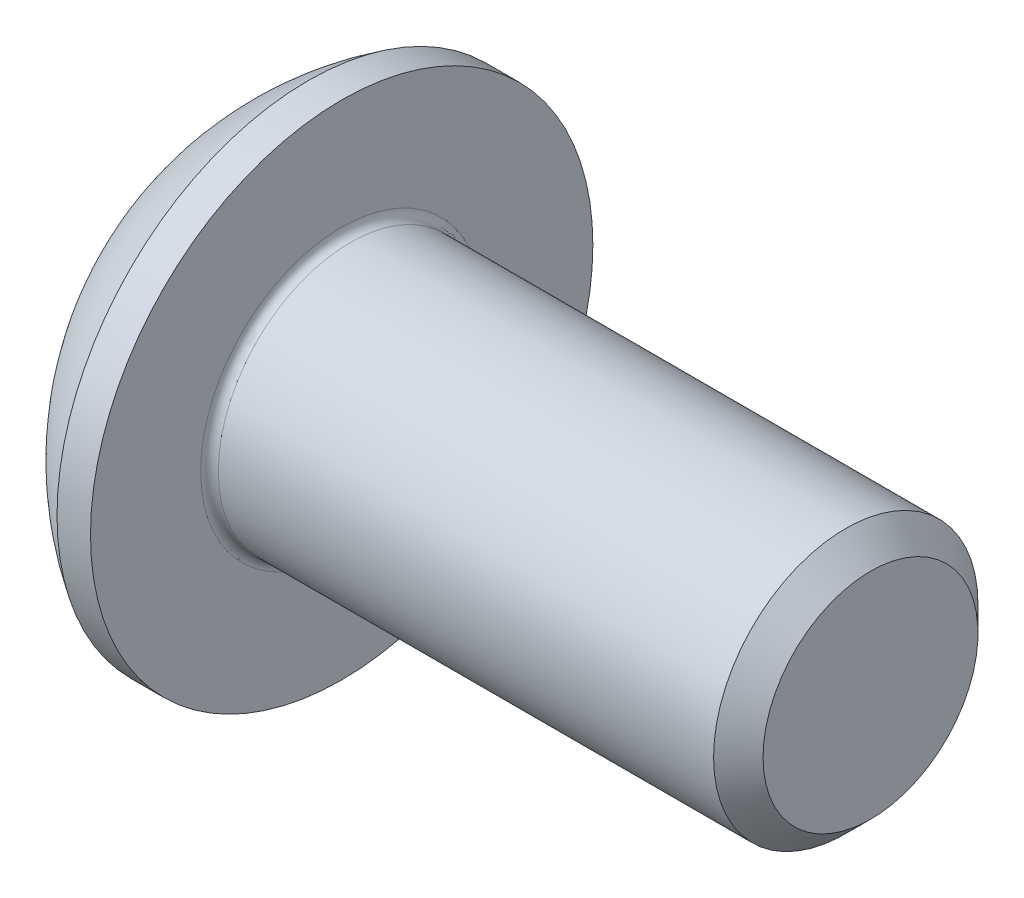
from build123d import *

# Parameters (mm, degrees)
FILLET1_R   = 0.1
HEX_2_DEPTH = 1.04


with BuildPart() as part:
    # BodySke → BaseBody (revolve)
    with BuildSketch(Plane.XY, mode=Mode.PRIVATE) as basebody_sk:
        with BuildLine():
            Line((7.65, 0), (7.65, 1.2195))
            Line((7.65, 1.2195), (7.3695, 1.5))
            Line((7.3695, 1.5), (1.65, 1.5))
            Line((1.65, 1.5), (1.65, 2.85))
            Line((1.65, 2.85), (1.27, 2.85))
            ThreePointArc((1.27, 2.85), (0.53140404, 2.229827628), (0, 1.425))
            Line((0, 1.425), (0, 0))
            Line((0, 0), (7.65, 0))
        make_face()
    revolve(basebody_sk.sketch.rotate(Axis((0, 0, 0), (1, 0, 0)), 90), axis=Axis((0, 0, 0), (1, 0, 0)))

    # Fillet1
    fillet1_edges = [part.edges().sort_by_distance(p)[0] for p in [
        (1.65, 0, -1.5),
    ]]
    fillet(fillet1_edges, radius=FILLET1_R)

    # Sketch2 → PreBroach (revolve, cut)
    with BuildSketch(Plane.XY, mode=Mode.PRIVATE) as prebroach_sk:
        Polygon((0, 1), (1.04, 1), (1.617350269, 0), (0, 0), align=None)
    revolve(prebroach_sk.sketch.rotate(Axis((0, 0, 0), (1, 0, 0)), 90), axis=Axis((0, 0, 0), (1, 0, 0)), mode=Mode.SUBTRACT)

    # Sketch3 → Hex 2 (cut)
    with BuildSketch(Plane(origin=(0, 0, 0), x_dir=(0, 0, -1), z_dir=(1, 0, 0))):
        Polygon((-1, -0.577350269), (-1, 0.577350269), (0, 1.154700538), (1, 0.577350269), (1, -0.577350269), (0, -1.154700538), align=None)
    extrude(amount=HEX_2_DEPTH, mode=Mode.SUBTRACT)


solid = part.part
